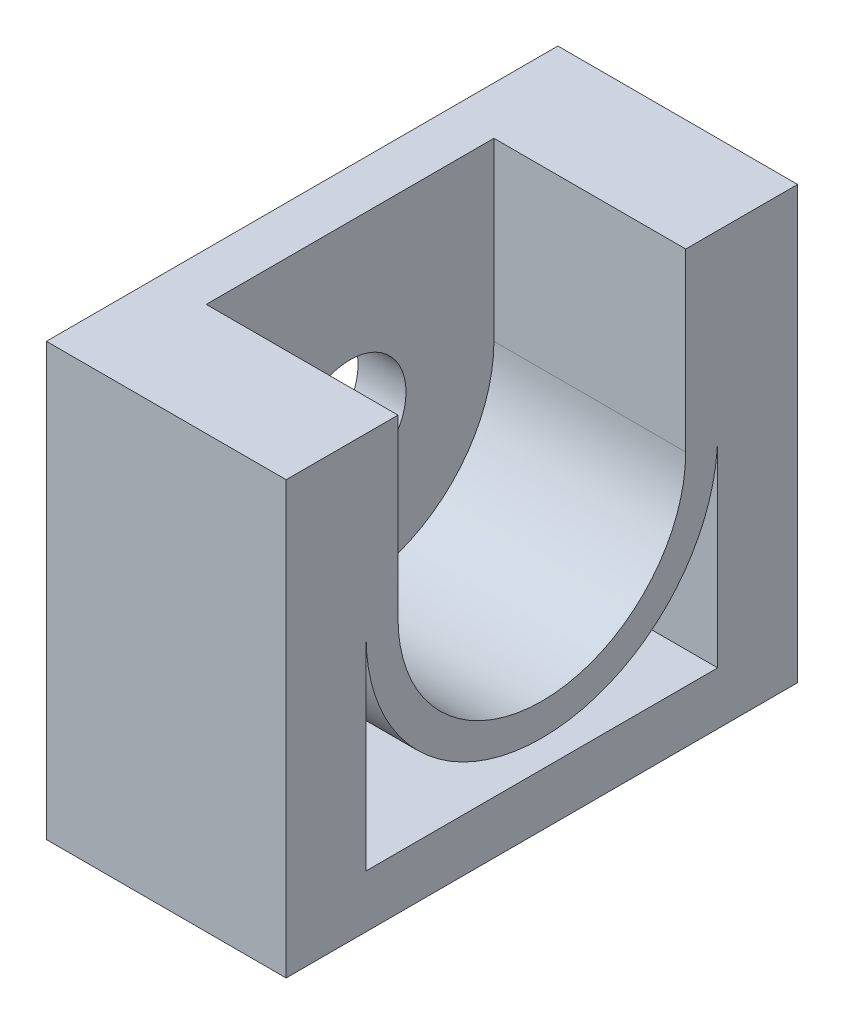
from build123d import *

# Parameters (mm, degrees)
BOSS_EXTRUDE2_DEPTH = 15
CUT_EXTRUDE1_DEPTH  = 12
SKETCH3_R           = 3.5
CUT_EXTRUDE2_DEPTH  = 20.646882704
SKETCH4_W           = 15
SKETCH4_H           = 11
BOSS_EXTRUDE3_DEPTH = 5
SKETCH5_W           = 15
SKETCH5_H           = 5
BOSS_EXTRUDE5_DEPTH = 16
SKETCH6_W           = 15
SKETCH6_H           = 11
BOSS_EXTRUDE6_DEPTH = 5
SKETCH7_W           = 15
SKETCH7_H           = 5
BOSS_EXTRUDE7_DEPTH = 16
SKETCH8_W           = 15
SKETCH8_H           = 3.302808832
BOSS_EXTRUDE9_DEPTH = 22


with BuildPart() as part:
    # Sketch1 → Boss-Extrude2 (new body)
    with BuildSketch(Plane(origin=(0, 0, 0), x_dir=(0, 0, -1), z_dir=(1, 0, 0))):
        with BuildLine():
            Line((-11, 0), (-11, 11))
            Line((-11, 11), (11, 11))
            Line((11, 11), (11, 0))
            ThreePointArc((11, 0), (0, -11), (-11, 0))
        make_face()
    extrude(amount=BOSS_EXTRUDE2_DEPTH)

    # Sketch2 → Cut-Extrude1 (cut)
    with BuildSketch(Plane(origin=(15, 0, 0), x_dir=(0, 0, -1), z_dir=(1, 0, 0))):
        with BuildLine():
            Line((-9, 0), (-9, 11))
            Line((-9, 11), (9, 11))
            Line((9, 11), (9, 0))
            ThreePointArc((9, 0), (0, -9), (-9, 0))
        make_face()
    extrude(amount=-CUT_EXTRUDE1_DEPTH, mode=Mode.SUBTRACT)

    # Sketch3 → Cut-Extrude2 (cut, through all)
    with BuildSketch(Plane(origin=(3, 0, 0), x_dir=(0, 0, -1), z_dir=(1, 0, 0))):
        Circle(SKETCH3_R)
    extrude(amount=-CUT_EXTRUDE2_DEPTH, mode=Mode.SUBTRACT)

    # Sketch4 → Boss-Extrude3 (add)
    with BuildSketch(Plane(origin=(0, 0, -11), x_dir=(-1, 0, 0), z_dir=(0, 0, -1))):
        with Locations((-7.5, 5.5)):
            Rectangle(SKETCH4_W, SKETCH4_H)
    extrude(amount=BOSS_EXTRUDE3_DEPTH)

    # Sketch5 → Boss-Extrude5 (add)
    with BuildSketch(Plane.XZ):
        with Locations((7.5, -13.5)):
            Rectangle(SKETCH5_W, SKETCH5_H)
    extrude(amount=BOSS_EXTRUDE5_DEPTH)

    # Sketch6 → Boss-Extrude6 (add)
    with BuildSketch(Plane.XY.offset(11)):
        with Locations((7.5, 5.5)):
            Rectangle(SKETCH6_W, SKETCH6_H)
    extrude(amount=BOSS_EXTRUDE6_DEPTH)

    # Sketch7 → Boss-Extrude7 (add)
    with BuildSketch(Plane.XZ):
        with Locations((7.5, 13.5)):
            Rectangle(SKETCH7_W, SKETCH7_H)
    extrude(amount=BOSS_EXTRUDE7_DEPTH)

    # Sketch8 → Boss-Extrude9 (add)
    with BuildSketch(Plane(origin=(0, 0, 11), x_dir=(-1, 0, 0), z_dir=(0, 0, -1))):
        with Locations((-7.5, -14.348595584)):
            Rectangle(SKETCH8_W, SKETCH8_H)
    extrude(amount=BOSS_EXTRUDE9_DEPTH)


solid = part.part
